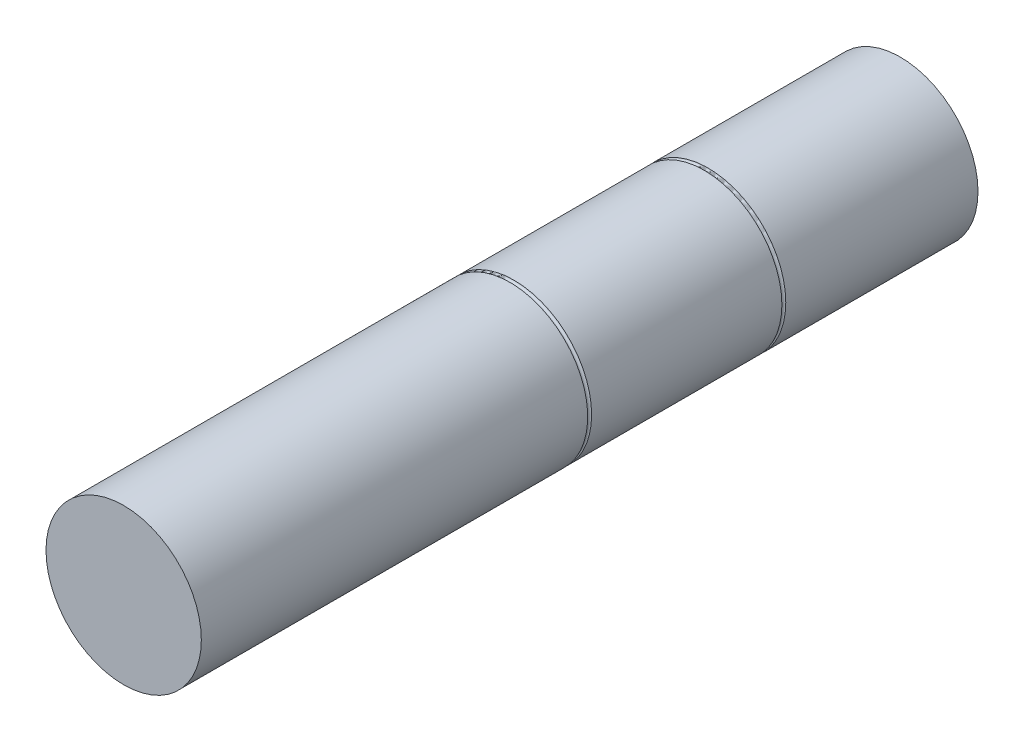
from build123d import *

# Parameters (mm, degrees)
SKIZZE1_R               = 10
LINEAR_AUSTRAGEN1_DEPTH = 100
SKIZZE2_R               = 0.25


with BuildPart() as part:
    # Skizze1 → Linear austragen1 (new body)
    with BuildSketch(Plane.XY):
        Circle(SKIZZE1_R)
    extrude(amount=LINEAR_AUSTRAGEN1_DEPTH)

    # Skizze2 → Schnitt-Rotation1 (revolve, cut)
    with BuildSketch(Plane(origin=(0, 0, 0), x_dir=(1, 0, 0), z_dir=(0, 1, 0)), mode=Mode.PRIVATE) as schnitt_rotation1_sk:
        with Locations((10, -25)):
            Circle(SKIZZE2_R)
        with Locations((10, -50)):
            Circle(SKIZZE2_R)
    revolve(schnitt_rotation1_sk.sketch.rotate(Axis((0, 0, 100), (0, 0, -1)), 180), axis=Axis((0, 0, 100), (0, 0, -1)), mode=Mode.SUBTRACT)


solid = part.part
